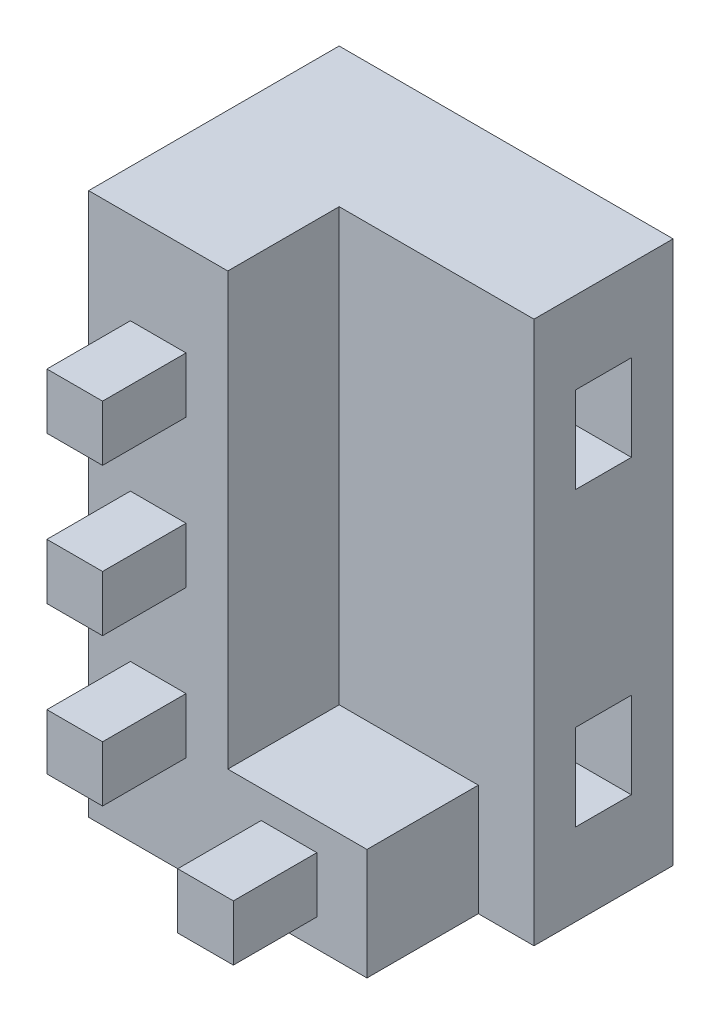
ISO-10303-21;
HEADER;
FILE_DESCRIPTION(('STEP AP214'),'2;1');
FILE_NAME('part.step','',(''),(''),'','','');
FILE_SCHEMA(('AUTOMOTIVE_DESIGN { 1 0 10303 214 1 1 1 1 }'));
ENDSEC;
DATA;
#1=APPLICATION_CONTEXT('core data for automotive mechanical design processes');
#2=APPLICATION_PROTOCOL_DEFINITION('international standard','automotive_design',2000,#1);
#3=PRODUCT_CONTEXT('',#1,'mechanical');
#4=PRODUCT('Part','Part','',(#3));
#5=PRODUCT_RELATED_PRODUCT_CATEGORY('part','',(#4));
#6=PRODUCT_DEFINITION_FORMATION('','',#4);
#7=PRODUCT_DEFINITION_CONTEXT('part definition',#1,'design');
#8=PRODUCT_DEFINITION('design','',#6,#7);
#9=PRODUCT_DEFINITION_SHAPE('','',#8);
#10=(LENGTH_UNIT() NAMED_UNIT(*) SI_UNIT(.MILLI.,.METRE.));
#11=(NAMED_UNIT(*) PLANE_ANGLE_UNIT() SI_UNIT($,.RADIAN.));
#12=(NAMED_UNIT(*) SI_UNIT($,.STERADIAN.) SOLID_ANGLE_UNIT());
#13=UNCERTAINTY_MEASURE_WITH_UNIT(LENGTH_MEASURE(1.E-05),#10,'distance_accuracy_value','');
#14=(GEOMETRIC_REPRESENTATION_CONTEXT(3) GLOBAL_UNCERTAINTY_ASSIGNED_CONTEXT((#13)) GLOBAL_UNIT_ASSIGNED_CONTEXT((#10,
#11,#12)) REPRESENTATION_CONTEXT('',''));
#15=CARTESIAN_POINT('',(0.,0.,0.));
#16=DIRECTION('',(0.,0.,1.));
#17=DIRECTION('',(1.,0.,0.));
#18=AXIS2_PLACEMENT_3D('',#15,#16,#17);
#19=CARTESIAN_POINT('',(-90.9999999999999,0.,-235.));
#20=DIRECTION('',(0.,0.,-1.));
#21=DIRECTION('',(-1.,0.,0.));
#22=AXIS2_PLACEMENT_3D('',#19,#20,#21);
#23=PLANE('',#22);
#24=DIRECTION('',(0.,-1.,0.));
#25=VECTOR('',#24,1.);
#26=CARTESIAN_POINT('',(-4.99999999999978,36.,-235.));
#27=LINE('',#26,#25);
#28=CARTESIAN_POINT('',(-4.99999999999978,56.,-235.));
#29=VERTEX_POINT('',#28);
#30=CARTESIAN_POINT('',(-4.99999999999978,36.,-235.));
#31=VERTEX_POINT('',#30);
#32=EDGE_CURVE('E444',#29,#31,#27,.T.);
#33=ORIENTED_EDGE('',*,*,#32,.F.);
#34=DIRECTION('',(-1.,0.,0.));
#35=VECTOR('',#34,1.);
#36=CARTESIAN_POINT('',(-4.99999999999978,56.,-235.));
#37=LINE('',#36,#35);
#38=CARTESIAN_POINT('',(15.0000000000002,56.,-235.));
#39=VERTEX_POINT('',#38);
#40=EDGE_CURVE('E431',#39,#29,#37,.T.);
#41=ORIENTED_EDGE('',*,*,#40,.F.);
#42=DIRECTION('',(0.,1.,0.));
#43=VECTOR('',#42,1.);
#44=CARTESIAN_POINT('',(15.0000000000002,56.,-235.));
#45=LINE('',#44,#43);
#46=CARTESIAN_POINT('',(15.0000000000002,36.,-235.));
#47=VERTEX_POINT('',#46);
#48=EDGE_CURVE('E435',#47,#39,#45,.T.);
#49=ORIENTED_EDGE('',*,*,#48,.F.);
#50=DIRECTION('',(1.,0.,0.));
#51=VECTOR('',#50,1.);
#52=CARTESIAN_POINT('',(15.0000000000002,36.,-235.));
#53=LINE('',#52,#51);
#54=EDGE_CURVE('E440',#31,#47,#53,.T.);
#55=ORIENTED_EDGE('',*,*,#54,.F.);
#56=EDGE_LOOP('',(#33,#41,#49,#55));
#57=FACE_BOUND('',#56,.T.);
#58=DIRECTION('',(-1.,0.,0.));
#59=VECTOR('',#58,1.);
#60=CARTESIAN_POINT('',(-4.99999999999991,162.,-235.));
#61=LINE('',#60,#59);
#62=CARTESIAN_POINT('',(15.0000000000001,162.,-235.));
#63=VERTEX_POINT('',#62);
#64=CARTESIAN_POINT('',(-4.99999999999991,162.,-235.));
#65=VERTEX_POINT('',#64);
#66=EDGE_CURVE('E493',#63,#65,#61,.T.);
#67=ORIENTED_EDGE('',*,*,#66,.F.);
#68=DIRECTION('',(0.,1.,0.));
#69=VECTOR('',#68,1.);
#70=CARTESIAN_POINT('',(15.0000000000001,162.,-235.));
#71=LINE('',#70,#69);
#72=CARTESIAN_POINT('',(15.0000000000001,142.,-235.));
#73=VERTEX_POINT('',#72);
#74=EDGE_CURVE('E510',#73,#63,#71,.T.);
#75=ORIENTED_EDGE('',*,*,#74,.F.);
#76=DIRECTION('',(1.,0.,0.));
#77=VECTOR('',#76,1.);
#78=CARTESIAN_POINT('',(15.0000000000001,142.,-235.));
#79=LINE('',#78,#77);
#80=CARTESIAN_POINT('',(-4.99999999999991,142.,-235.));
#81=VERTEX_POINT('',#80);
#82=EDGE_CURVE('E527',#81,#73,#79,.T.);
#83=ORIENTED_EDGE('',*,*,#82,.F.);
#84=DIRECTION('',(0.,-1.,0.));
#85=VECTOR('',#84,1.);
#86=CARTESIAN_POINT('',(-4.99999999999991,162.,-235.));
#87=LINE('',#86,#85);
#88=EDGE_CURVE('E523',#65,#81,#87,.T.);
#89=ORIENTED_EDGE('',*,*,#88,.F.);
#90=EDGE_LOOP('',(#67,#75,#83,#89));
#91=FACE_BOUND('',#90,.T.);
#92=DIRECTION('',(0.,1.,0.));
#93=VECTOR('',#92,1.);
#94=CARTESIAN_POINT('',(-20.,250.,-235.));
#95=LINE('',#94,#93);
#96=CARTESIAN_POINT('',(-19.9999999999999,0.,-235.));
#97=VERTEX_POINT('',#96);
#98=CARTESIAN_POINT('',(-20.,195.,-235.));
#99=VERTEX_POINT('',#98);
#100=EDGE_CURVE('E588',#97,#99,#95,.T.);
#101=ORIENTED_EDGE('',*,*,#100,.F.);
#102=DIRECTION('',(-1.,0.,0.));
#103=VECTOR('',#102,1.);
#104=CARTESIAN_POINT('',(-90.9999999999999,0.,-235.));
#105=LINE('',#104,#103);
#106=CARTESIAN_POINT('',(80.,0.,-235.));
#107=VERTEX_POINT('',#106);
#108=EDGE_CURVE('E580',#107,#97,#105,.T.);
#109=ORIENTED_EDGE('',*,*,#108,.F.);
#110=DIRECTION('',(0.,1.,0.));
#111=VECTOR('',#110,1.);
#112=CARTESIAN_POINT('',(80.,0.,-235.));
#113=LINE('',#112,#111);
#114=CARTESIAN_POINT('',(80.,40.,-235.));
#115=VERTEX_POINT('',#114);
#116=EDGE_CURVE('E554',#107,#115,#113,.T.);
#117=ORIENTED_EDGE('',*,*,#116,.T.);
#118=DIRECTION('',(1.,0.,0.));
#119=VECTOR('',#118,1.);
#120=CARTESIAN_POINT('',(30.,40.,-235.));
#121=LINE('',#120,#119);
#122=CARTESIAN_POINT('',(30.,40.,-235.));
#123=VERTEX_POINT('',#122);
#124=EDGE_CURVE('E559',#123,#115,#121,.T.);
#125=ORIENTED_EDGE('',*,*,#124,.F.);
#126=DIRECTION('',(0.,-1.,0.));
#127=VECTOR('',#126,1.);
#128=CARTESIAN_POINT('',(30.,250.,-235.));
#129=LINE('',#128,#127);
#130=CARTESIAN_POINT('',(30.,195.,-235.));
#131=VERTEX_POINT('',#130);
#132=EDGE_CURVE('E12',#131,#123,#129,.T.);
#133=ORIENTED_EDGE('',*,*,#132,.F.);
#134=DIRECTION('',(1.,0.,0.));
#135=VECTOR('',#134,1.);
#136=CARTESIAN_POINT('',(0.,195.,-235.));
#137=LINE('',#136,#135);
#138=EDGE_CURVE('E584',#99,#131,#137,.T.);
#139=ORIENTED_EDGE('',*,*,#138,.F.);
#140=EDGE_LOOP('',(#101,#109,#117,#125,#133,#139));
#141=FACE_BOUND('',#140,.T.);
#142=DIRECTION('',(0.,-1.,0.));
#143=VECTOR('',#142,1.);
#144=CARTESIAN_POINT('',(-4.99999999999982,89.,-235.));
#145=LINE('',#144,#143);
#146=CARTESIAN_POINT('',(-4.99999999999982,109.,-235.));
#147=VERTEX_POINT('',#146);
#148=CARTESIAN_POINT('',(-4.99999999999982,89.,-235.));
#149=VERTEX_POINT('',#148);
#150=EDGE_CURVE('E489',#147,#149,#145,.T.);
#151=ORIENTED_EDGE('',*,*,#150,.F.);
#152=DIRECTION('',(-1.,0.,0.));
#153=VECTOR('',#152,1.);
#154=CARTESIAN_POINT('',(-4.99999999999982,109.,-235.));
#155=LINE('',#154,#153);
#156=CARTESIAN_POINT('',(15.0000000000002,109.,-235.));
#157=VERTEX_POINT('',#156);
#158=EDGE_CURVE('E476',#157,#147,#155,.T.);
#159=ORIENTED_EDGE('',*,*,#158,.F.);
#160=DIRECTION('',(0.,1.,0.));
#161=VECTOR('',#160,1.);
#162=CARTESIAN_POINT('',(15.0000000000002,109.,-235.));
#163=LINE('',#162,#161);
#164=CARTESIAN_POINT('',(15.0000000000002,89.,-235.));
#165=VERTEX_POINT('',#164);
#166=EDGE_CURVE('E480',#165,#157,#163,.T.);
#167=ORIENTED_EDGE('',*,*,#166,.F.);
#168=DIRECTION('',(1.,0.,0.));
#169=VECTOR('',#168,1.);
#170=CARTESIAN_POINT('',(15.0000000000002,89.,-235.));
#171=LINE('',#170,#169);
#172=EDGE_CURVE('E485',#149,#165,#171,.T.);
#173=ORIENTED_EDGE('',*,*,#172,.F.);
#174=EDGE_LOOP('',(#151,#159,#167,#173));
#175=FACE_BOUND('',#174,.T.);
#176=DIRECTION('',(0.,-1.,0.));
#177=VECTOR('',#176,1.);
#178=CARTESIAN_POINT('',(42.0000000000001,10.,-235.));
#179=LINE('',#178,#177);
#180=CARTESIAN_POINT('',(42.0000000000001,30.,-235.));
#181=VERTEX_POINT('',#180);
#182=CARTESIAN_POINT('',(42.0000000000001,10.,-235.));
#183=VERTEX_POINT('',#182);
#184=EDGE_CURVE('E399',#181,#183,#179,.T.);
#185=ORIENTED_EDGE('',*,*,#184,.F.);
#186=DIRECTION('',(-1.,0.,0.));
#187=VECTOR('',#186,1.);
#188=CARTESIAN_POINT('',(42.0000000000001,30.,-235.));
#189=LINE('',#188,#187);
#190=CARTESIAN_POINT('',(62.0000000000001,30.,-235.));
#191=VERTEX_POINT('',#190);
#192=EDGE_CURVE('E386',#191,#181,#189,.T.);
#193=ORIENTED_EDGE('',*,*,#192,.F.);
#194=DIRECTION('',(0.,1.,0.));
#195=VECTOR('',#194,1.);
#196=CARTESIAN_POINT('',(62.0000000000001,30.,-235.));
#197=LINE('',#196,#195);
#198=CARTESIAN_POINT('',(62.0000000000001,10.,-235.));
#199=VERTEX_POINT('',#198);
#200=EDGE_CURVE('E390',#199,#191,#197,.T.);
#201=ORIENTED_EDGE('',*,*,#200,.F.);
#202=DIRECTION('',(1.,0.,0.));
#203=VECTOR('',#202,1.);
#204=CARTESIAN_POINT('',(62.0000000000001,10.,-235.));
#205=LINE('',#204,#203);
#206=EDGE_CURVE('E395',#183,#199,#205,.T.);
#207=ORIENTED_EDGE('',*,*,#206,.F.);
#208=EDGE_LOOP('',(#185,#193,#201,#207));
#209=FACE_BOUND('',#208,.T.);
#210=ADVANCED_FACE('F53',(#57,#91,#141,#175,#209),#23,.F.);
#211=CARTESIAN_POINT('',(230.,250.,-275.011815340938));
#212=DIRECTION('',(0.,0.,-1.));
#213=DIRECTION('',(-1.,0.,0.));
#214=AXIS2_PLACEMENT_3D('',#211,#212,#213);
#215=PLANE('',#214);
#216=DIRECTION('',(-1.,0.,0.));
#217=VECTOR('',#216,1.);
#218=CARTESIAN_POINT('',(230.,0.,-275.011815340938));
#219=LINE('',#218,#217);
#220=CARTESIAN_POINT('',(100.,0.,-275.011815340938));
#221=VERTEX_POINT('',#220);
#222=CARTESIAN_POINT('',(80.,0.,-275.011815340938));
#223=VERTEX_POINT('',#222);
#224=EDGE_CURVE('E610',#221,#223,#219,.T.);
#225=ORIENTED_EDGE('',*,*,#224,.F.);
#226=DIRECTION('',(0.,1.,0.));
#227=VECTOR('',#226,1.);
#228=CARTESIAN_POINT('',(100.,250.,-275.011815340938));
#229=LINE('',#228,#227);
#230=CARTESIAN_POINT('',(100.,195.,-275.011815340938));
#231=VERTEX_POINT('',#230);
#232=EDGE_CURVE('E363',#221,#231,#229,.T.);
#233=ORIENTED_EDGE('',*,*,#232,.T.);
#234=DIRECTION('',(1.,0.,0.));
#235=VECTOR('',#234,1.);
#236=CARTESIAN_POINT('',(230.,195.,-275.011815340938));
#237=LINE('',#236,#235);
#238=CARTESIAN_POINT('',(30.,195.,-275.011815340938));
#239=VERTEX_POINT('',#238);
#240=EDGE_CURVE('E599',#239,#231,#237,.T.);
#241=ORIENTED_EDGE('',*,*,#240,.F.);
#242=DIRECTION('',(0.,-1.,0.));
#243=VECTOR('',#242,1.);
#244=CARTESIAN_POINT('',(30.,250.,-275.011815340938));
#245=LINE('',#244,#243);
#246=CARTESIAN_POINT('',(30.,40.,-275.011815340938));
#247=VERTEX_POINT('',#246);
#248=EDGE_CURVE('E606',#239,#247,#245,.T.);
#249=ORIENTED_EDGE('',*,*,#248,.T.);
#250=DIRECTION('',(-1.,0.,0.));
#251=VECTOR('',#250,1.);
#252=CARTESIAN_POINT('',(30.,40.,-275.011815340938));
#253=LINE('',#252,#251);
#254=CARTESIAN_POINT('',(80.,40.,-275.011815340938));
#255=VERTEX_POINT('',#254);
#256=EDGE_CURVE('E555',#255,#247,#253,.T.);
#257=ORIENTED_EDGE('',*,*,#256,.F.);
#258=DIRECTION('',(0.,1.,0.));
#259=VECTOR('',#258,1.);
#260=CARTESIAN_POINT('',(80.,0.,-275.011815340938));
#261=LINE('',#260,#259);
#262=EDGE_CURVE('E570',#223,#255,#261,.T.);
#263=ORIENTED_EDGE('',*,*,#262,.F.);
#264=EDGE_LOOP('',(#225,#233,#241,#249,#257,#263));
#265=FACE_BOUND('',#264,.T.);
#266=ADVANCED_FACE('F647',(#265),#215,.F.);
#267=CARTESIAN_POINT('',(-20.,250.,0.));
#268=DIRECTION('',(1.,0.,0.));
#269=DIRECTION('',(0.,0.,-1.));
#270=AXIS2_PLACEMENT_3D('',#267,#268,#269);
#271=PLANE('',#270);
#272=DIRECTION('',(0.,1.,0.));
#273=VECTOR('',#272,1.);
#274=CARTESIAN_POINT('',(-19.9999999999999,62.5,-325.));
#275=LINE('',#274,#273);
#276=CARTESIAN_POINT('',(-19.9999999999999,0.,-325.));
#277=VERTEX_POINT('',#276);
#278=CARTESIAN_POINT('',(-19.9999999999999,195.,-325.));
#279=VERTEX_POINT('',#278);
#280=EDGE_CURVE('E62',#277,#279,#275,.T.);
#281=ORIENTED_EDGE('',*,*,#280,.F.);
#282=DIRECTION('',(0.,0.,-1.));
#283=VECTOR('',#282,1.);
#284=CARTESIAN_POINT('',(-19.9999999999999,0.,-325.));
#285=LINE('',#284,#283);
#286=EDGE_CURVE('E574',#97,#277,#285,.T.);
#287=ORIENTED_EDGE('',*,*,#286,.F.);
#288=ORIENTED_EDGE('',*,*,#100,.T.);
#289=DIRECTION('',(0.,0.,-1.));
#290=VECTOR('',#289,1.);
#291=CARTESIAN_POINT('',(-20.,195.,0.));
#292=LINE('',#291,#290);
#293=EDGE_CURVE('E595',#99,#279,#292,.T.);
#294=ORIENTED_EDGE('',*,*,#293,.T.);
#295=EDGE_LOOP('',(#281,#287,#288,#294));
#296=FACE_BOUND('',#295,.T.);
#297=ADVANCED_FACE('F624',(#296),#271,.F.);
#298=CARTESIAN_POINT('',(0.,0.,0.));
#299=DIRECTION('',(0.,-1.,0.));
#300=DIRECTION('',(0.,0.,-1.));
#301=AXIS2_PLACEMENT_3D('',#298,#299,#300);
#302=PLANE('',#301);
#303=DIRECTION('',(0.,0.,1.));
#304=VECTOR('',#303,1.);
#305=CARTESIAN_POINT('',(100.,0.,-325.));
#306=LINE('',#305,#304);
#307=CARTESIAN_POINT('',(100.,0.,-325.));
#308=VERTEX_POINT('',#307);
#309=EDGE_CURVE('E359',#308,#221,#306,.T.);
#310=ORIENTED_EDGE('',*,*,#309,.T.);
#311=ORIENTED_EDGE('',*,*,#224,.T.);
#312=DIRECTION('',(0.,0.,-1.));
#313=VECTOR('',#312,1.);
#314=CARTESIAN_POINT('',(80.,0.,-235.));
#315=LINE('',#314,#313);
#316=EDGE_CURVE('E550',#107,#223,#315,.T.);
#317=ORIENTED_EDGE('',*,*,#316,.F.);
#318=ORIENTED_EDGE('',*,*,#108,.T.);
#319=ORIENTED_EDGE('',*,*,#286,.T.);
#320=DIRECTION('',(-1.,0.,0.));
#321=VECTOR('',#320,1.);
#322=CARTESIAN_POINT('',(101.037708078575,0.,-325.));
#323=LINE('',#322,#321);
#324=EDGE_CURVE('E613',#308,#277,#323,.T.);
#325=ORIENTED_EDGE('',*,*,#324,.F.);
#326=EDGE_LOOP('',(#310,#311,#317,#318,#319,#325));
#327=FACE_BOUND('',#326,.T.);
#328=ADVANCED_FACE('F627',(#327),#302,.T.);
#329=CARTESIAN_POINT('',(101.037708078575,71.6208477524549,-325.));
#330=DIRECTION('',(0.,0.,-1.));
#331=DIRECTION('',(-1.,0.,0.));
#332=AXIS2_PLACEMENT_3D('',#329,#330,#331);
#333=PLANE('',#332);
#334=DIRECTION('',(0.,-1.,0.));
#335=VECTOR('',#334,1.);
#336=CARTESIAN_POINT('',(100.,0.,-325.));
#337=LINE('',#336,#335);
#338=CARTESIAN_POINT('',(100.,195.,-325.));
#339=VERTEX_POINT('',#338);
#340=EDGE_CURVE('E309',#339,#308,#337,.T.);
#341=ORIENTED_EDGE('',*,*,#340,.T.);
#342=ORIENTED_EDGE('',*,*,#324,.T.);
#343=ORIENTED_EDGE('',*,*,#280,.T.);
#344=DIRECTION('',(-1.,0.,0.));
#345=VECTOR('',#344,1.);
#346=CARTESIAN_POINT('',(30.,195.,-325.));
#347=LINE('',#346,#345);
#348=EDGE_CURVE('E603',#339,#279,#347,.T.);
#349=ORIENTED_EDGE('',*,*,#348,.F.);
#350=EDGE_LOOP('',(#341,#342,#343,#349));
#351=FACE_BOUND('',#350,.T.);
#352=ADVANCED_FACE('F620',(#351),#333,.T.);
#353=CARTESIAN_POINT('',(0.,195.,0.));
#354=DIRECTION('',(0.,-1.,0.));
#355=DIRECTION('',(0.,0.,-1.));
#356=AXIS2_PLACEMENT_3D('',#353,#354,#355);
#357=PLANE('',#356);
#358=ORIENTED_EDGE('',*,*,#240,.T.);
#359=DIRECTION('',(0.,0.,1.));
#360=VECTOR('',#359,1.);
#361=CARTESIAN_POINT('',(100.,195.,-325.));
#362=LINE('',#361,#360);
#363=EDGE_CURVE('E358',#339,#231,#362,.T.);
#364=ORIENTED_EDGE('',*,*,#363,.F.);
#365=ORIENTED_EDGE('',*,*,#348,.T.);
#366=ORIENTED_EDGE('',*,*,#293,.F.);
#367=ORIENTED_EDGE('',*,*,#138,.T.);
#368=DIRECTION('',(0.,0.,-1.));
#369=VECTOR('',#368,1.);
#370=CARTESIAN_POINT('',(30.,195.,-142.943134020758));
#371=LINE('',#370,#369);
#372=EDGE_CURVE('E592',#131,#239,#371,.T.);
#373=ORIENTED_EDGE('',*,*,#372,.T.);
#374=EDGE_LOOP('',(#358,#364,#365,#366,#367,#373));
#375=FACE_BOUND('',#374,.T.);
#376=ADVANCED_FACE('F642',(#375),#357,.F.);
#377=CARTESIAN_POINT('',(30.,250.,-150.));
#378=DIRECTION('',(-1.,0.,0.));
#379=DIRECTION('',(0.,0.,1.));
#380=AXIS2_PLACEMENT_3D('',#377,#378,#379);
#381=PLANE('',#380);
#382=ORIENTED_EDGE('',*,*,#132,.T.);
#383=DIRECTION('',(0.,0.,1.));
#384=VECTOR('',#383,1.);
#385=CARTESIAN_POINT('',(30.,40.,-275.011815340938));
#386=LINE('',#385,#384);
#387=EDGE_CURVE('E549',#247,#123,#386,.T.);
#388=ORIENTED_EDGE('',*,*,#387,.F.);
#389=ORIENTED_EDGE('',*,*,#248,.F.);
#390=ORIENTED_EDGE('',*,*,#372,.F.);
#391=EDGE_LOOP('',(#382,#388,#389,#390));
#392=FACE_BOUND('',#391,.T.);
#393=ADVANCED_FACE('F55',(#392),#381,.F.);
#394=CARTESIAN_POINT('',(80.,0.,-235.));
#395=DIRECTION('',(1.,0.,0.));
#396=DIRECTION('',(0.,0.,-1.));
#397=AXIS2_PLACEMENT_3D('',#394,#395,#396);
#398=PLANE('',#397);
#399=DIRECTION('',(0.,0.,-1.));
#400=VECTOR('',#399,1.);
#401=CARTESIAN_POINT('',(80.,40.,-235.));
#402=LINE('',#401,#400);
#403=EDGE_CURVE('E563',#115,#255,#402,.T.);
#404=ORIENTED_EDGE('',*,*,#403,.F.);
#405=ORIENTED_EDGE('',*,*,#116,.F.);
#406=ORIENTED_EDGE('',*,*,#316,.T.);
#407=ORIENTED_EDGE('',*,*,#262,.T.);
#408=EDGE_LOOP('',(#404,#405,#406,#407));
#409=FACE_BOUND('',#408,.T.);
#410=ADVANCED_FACE('F635',(#409),#398,.T.);
#411=CARTESIAN_POINT('',(0.,40.,0.));
#412=DIRECTION('',(0.,1.,0.));
#413=DIRECTION('',(0.,0.,1.));
#414=AXIS2_PLACEMENT_3D('',#411,#412,#413);
#415=PLANE('',#414);
#416=ORIENTED_EDGE('',*,*,#387,.T.);
#417=ORIENTED_EDGE('',*,*,#124,.T.);
#418=ORIENTED_EDGE('',*,*,#403,.T.);
#419=ORIENTED_EDGE('',*,*,#256,.T.);
#420=EDGE_LOOP('',(#416,#417,#418,#419));
#421=FACE_BOUND('',#420,.T.);
#422=ADVANCED_FACE('F638',(#421),#415,.T.);
#423=CARTESIAN_POINT('',(-4.99999999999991,162.,-205.));
#424=DIRECTION('',(0.,-1.,0.));
#425=DIRECTION('',(0.,0.,-1.));
#426=AXIS2_PLACEMENT_3D('',#423,#424,#425);
#427=PLANE('',#426);
#428=ORIENTED_EDGE('',*,*,#66,.T.);
#429=DIRECTION('',(0.,0.,-1.));
#430=VECTOR('',#429,1.);
#431=CARTESIAN_POINT('',(-4.99999999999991,162.,-205.));
#432=LINE('',#431,#430);
#433=CARTESIAN_POINT('',(-4.99999999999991,162.,-205.));
#434=VERTEX_POINT('',#433);
#435=EDGE_CURVE('E545',#434,#65,#432,.T.);
#436=ORIENTED_EDGE('',*,*,#435,.F.);
#437=DIRECTION('',(-1.,0.,0.));
#438=VECTOR('',#437,1.);
#439=CARTESIAN_POINT('',(-4.99999999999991,162.,-205.));
#440=LINE('',#439,#438);
#441=CARTESIAN_POINT('',(15.0000000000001,162.,-205.));
#442=VERTEX_POINT('',#441);
#443=EDGE_CURVE('E505',#442,#434,#440,.T.);
#444=ORIENTED_EDGE('',*,*,#443,.F.);
#445=DIRECTION('',(0.,0.,-1.));
#446=VECTOR('',#445,1.);
#447=CARTESIAN_POINT('',(15.0000000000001,162.,-205.));
#448=LINE('',#447,#446);
#449=EDGE_CURVE('E519',#442,#63,#448,.T.);
#450=ORIENTED_EDGE('',*,*,#449,.T.);
#451=EDGE_LOOP('',(#428,#436,#444,#450));
#452=FACE_BOUND('',#451,.T.);
#453=ADVANCED_FACE('F731',(#452),#427,.F.);
#454=CARTESIAN_POINT('',(-4.99999999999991,162.,-205.));
#455=DIRECTION('',(1.,0.,0.));
#456=DIRECTION('',(0.,1.,0.));
#457=AXIS2_PLACEMENT_3D('',#454,#455,#456);
#458=PLANE('',#457);
#459=ORIENTED_EDGE('',*,*,#88,.T.);
#460=DIRECTION('',(0.,0.,-1.));
#461=VECTOR('',#460,1.);
#462=CARTESIAN_POINT('',(-4.9999999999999,142.,-205.));
#463=LINE('',#462,#461);
#464=CARTESIAN_POINT('',(-4.9999999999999,142.,-205.));
#465=VERTEX_POINT('',#464);
#466=EDGE_CURVE('E541',#465,#81,#463,.T.);
#467=ORIENTED_EDGE('',*,*,#466,.F.);
#468=DIRECTION('',(0.,-1.,0.));
#469=VECTOR('',#468,1.);
#470=CARTESIAN_POINT('',(-4.99999999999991,162.,-205.));
#471=LINE('',#470,#469);
#472=EDGE_CURVE('E509',#434,#465,#471,.T.);
#473=ORIENTED_EDGE('',*,*,#472,.F.);
#474=ORIENTED_EDGE('',*,*,#435,.T.);
#475=EDGE_LOOP('',(#459,#467,#473,#474));
#476=FACE_BOUND('',#475,.T.);
#477=ADVANCED_FACE('F737',(#476),#458,.F.);
#478=CARTESIAN_POINT('',(15.0000000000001,142.,-205.));
#479=DIRECTION('',(0.,1.,0.));
#480=DIRECTION('',(0.,0.,1.));
#481=AXIS2_PLACEMENT_3D('',#478,#479,#480);
#482=PLANE('',#481);
#483=ORIENTED_EDGE('',*,*,#82,.T.);
#484=DIRECTION('',(0.,0.,-1.));
#485=VECTOR('',#484,1.);
#486=CARTESIAN_POINT('',(15.0000000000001,142.,-205.));
#487=LINE('',#486,#485);
#488=CARTESIAN_POINT('',(15.0000000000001,142.,-205.));
#489=VERTEX_POINT('',#488);
#490=EDGE_CURVE('E537',#489,#73,#487,.T.);
#491=ORIENTED_EDGE('',*,*,#490,.F.);
#492=DIRECTION('',(1.,0.,0.));
#493=VECTOR('',#492,1.);
#494=CARTESIAN_POINT('',(15.0000000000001,142.,-205.));
#495=LINE('',#494,#493);
#496=EDGE_CURVE('E513',#465,#489,#495,.T.);
#497=ORIENTED_EDGE('',*,*,#496,.F.);
#498=ORIENTED_EDGE('',*,*,#466,.T.);
#499=EDGE_LOOP('',(#483,#491,#497,#498));
#500=FACE_BOUND('',#499,.T.);
#501=ADVANCED_FACE('F745',(#500),#482,.F.);
#502=CARTESIAN_POINT('',(15.0000000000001,162.,-205.));
#503=DIRECTION('',(-1.,0.,0.));
#504=DIRECTION('',(0.,-1.,0.));
#505=AXIS2_PLACEMENT_3D('',#502,#503,#504);
#506=PLANE('',#505);
#507=ORIENTED_EDGE('',*,*,#74,.T.);
#508=ORIENTED_EDGE('',*,*,#449,.F.);
#509=DIRECTION('',(0.,1.,0.));
#510=VECTOR('',#509,1.);
#511=CARTESIAN_POINT('',(15.0000000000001,162.,-205.));
#512=LINE('',#511,#510);
#513=EDGE_CURVE('E516',#489,#442,#512,.T.);
#514=ORIENTED_EDGE('',*,*,#513,.F.);
#515=ORIENTED_EDGE('',*,*,#490,.T.);
#516=EDGE_LOOP('',(#507,#508,#514,#515));
#517=FACE_BOUND('',#516,.T.);
#518=ADVANCED_FACE('F753',(#517),#506,.F.);
#519=CARTESIAN_POINT('',(0.,0.,-205.));
#520=DIRECTION('',(0.,0.,-1.));
#521=DIRECTION('',(-1.,0.,0.));
#522=AXIS2_PLACEMENT_3D('',#519,#520,#521);
#523=PLANE('',#522);
#524=ORIENTED_EDGE('',*,*,#443,.T.);
#525=ORIENTED_EDGE('',*,*,#472,.T.);
#526=ORIENTED_EDGE('',*,*,#496,.T.);
#527=ORIENTED_EDGE('',*,*,#513,.T.);
#528=EDGE_LOOP('',(#524,#525,#526,#527));
#529=FACE_BOUND('',#528,.T.);
#530=ADVANCED_FACE('F761',(#529),#523,.F.);
#531=CARTESIAN_POINT('',(-4.99999999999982,89.,-205.));
#532=DIRECTION('',(1.,0.,0.));
#533=DIRECTION('',(0.,0.,-1.));
#534=AXIS2_PLACEMENT_3D('',#531,#532,#533);
#535=PLANE('',#534);
#536=ORIENTED_EDGE('',*,*,#150,.T.);
#537=DIRECTION('',(0.,0.,-1.));
#538=VECTOR('',#537,1.);
#539=CARTESIAN_POINT('',(-4.99999999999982,89.,-205.));
#540=LINE('',#539,#538);
#541=CARTESIAN_POINT('',(-4.99999999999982,89.,-205.));
#542=VERTEX_POINT('',#541);
#543=EDGE_CURVE('E448',#542,#149,#540,.T.);
#544=ORIENTED_EDGE('',*,*,#543,.F.);
#545=DIRECTION('',(0.,-1.,0.));
#546=VECTOR('',#545,1.);
#547=CARTESIAN_POINT('',(-4.99999999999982,89.,-205.));
#548=LINE('',#547,#546);
#549=CARTESIAN_POINT('',(-4.99999999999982,109.,-205.));
#550=VERTEX_POINT('',#549);
#551=EDGE_CURVE('E481',#550,#542,#548,.T.);
#552=ORIENTED_EDGE('',*,*,#551,.F.);
#553=DIRECTION('',(0.,0.,-1.));
#554=VECTOR('',#553,1.);
#555=CARTESIAN_POINT('',(-4.99999999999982,109.,-205.));
#556=LINE('',#555,#554);
#557=EDGE_CURVE('E471',#550,#147,#556,.T.);
#558=ORIENTED_EDGE('',*,*,#557,.T.);
#559=EDGE_LOOP('',(#536,#544,#552,#558));
#560=FACE_BOUND('',#559,.T.);
#561=ADVANCED_FACE('F769',(#560),#535,.F.);
#562=CARTESIAN_POINT('',(15.0000000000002,89.,-205.));
#563=DIRECTION('',(0.,1.,0.));
#564=DIRECTION('',(0.,0.,1.));
#565=AXIS2_PLACEMENT_3D('',#562,#563,#564);
#566=PLANE('',#565);
#567=ORIENTED_EDGE('',*,*,#172,.T.);
#568=DIRECTION('',(0.,0.,-1.));
#569=VECTOR('',#568,1.);
#570=CARTESIAN_POINT('',(15.0000000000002,89.,-205.));
#571=LINE('',#570,#569);
#572=CARTESIAN_POINT('',(15.0000000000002,89.,-205.));
#573=VERTEX_POINT('',#572);
#574=EDGE_CURVE('E463',#573,#165,#571,.T.);
#575=ORIENTED_EDGE('',*,*,#574,.F.);
#576=DIRECTION('',(1.,0.,0.));
#577=VECTOR('',#576,1.);
#578=CARTESIAN_POINT('',(15.0000000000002,89.,-205.));
#579=LINE('',#578,#577);
#580=EDGE_CURVE('E499',#542,#573,#579,.T.);
#581=ORIENTED_EDGE('',*,*,#580,.F.);
#582=ORIENTED_EDGE('',*,*,#543,.T.);
#583=EDGE_LOOP('',(#567,#575,#581,#582));
#584=FACE_BOUND('',#583,.T.);
#585=ADVANCED_FACE('F777',(#584),#566,.F.);
#586=CARTESIAN_POINT('',(15.0000000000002,109.,-205.));
#587=DIRECTION('',(-1.,0.,0.));
#588=DIRECTION('',(0.,0.,1.));
#589=AXIS2_PLACEMENT_3D('',#586,#587,#588);
#590=PLANE('',#589);
#591=ORIENTED_EDGE('',*,*,#166,.T.);
#592=DIRECTION('',(0.,0.,-1.));
#593=VECTOR('',#592,1.);
#594=CARTESIAN_POINT('',(15.0000000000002,109.,-205.));
#595=LINE('',#594,#593);
#596=CARTESIAN_POINT('',(15.0000000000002,109.,-205.));
#597=VERTEX_POINT('',#596);
#598=EDGE_CURVE('E467',#597,#157,#595,.T.);
#599=ORIENTED_EDGE('',*,*,#598,.F.);
#600=DIRECTION('',(0.,1.,0.));
#601=VECTOR('',#600,1.);
#602=CARTESIAN_POINT('',(15.0000000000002,109.,-205.));
#603=LINE('',#602,#601);
#604=EDGE_CURVE('E496',#573,#597,#603,.T.);
#605=ORIENTED_EDGE('',*,*,#604,.F.);
#606=ORIENTED_EDGE('',*,*,#574,.T.);
#607=EDGE_LOOP('',(#591,#599,#605,#606));
#608=FACE_BOUND('',#607,.T.);
#609=ADVANCED_FACE('F785',(#608),#590,.F.);
#610=CARTESIAN_POINT('',(-4.99999999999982,109.,-205.));
#611=DIRECTION('',(0.,-1.,0.));
#612=DIRECTION('',(0.,0.,-1.));
#613=AXIS2_PLACEMENT_3D('',#610,#611,#612);
#614=PLANE('',#613);
#615=ORIENTED_EDGE('',*,*,#158,.T.);
#616=ORIENTED_EDGE('',*,*,#557,.F.);
#617=DIRECTION('',(-1.,0.,0.));
#618=VECTOR('',#617,1.);
#619=CARTESIAN_POINT('',(-4.99999999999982,109.,-205.));
#620=LINE('',#619,#618);
#621=EDGE_CURVE('E475',#597,#550,#620,.T.);
#622=ORIENTED_EDGE('',*,*,#621,.F.);
#623=ORIENTED_EDGE('',*,*,#598,.T.);
#624=EDGE_LOOP('',(#615,#616,#622,#623));
#625=FACE_BOUND('',#624,.T.);
#626=ADVANCED_FACE('F793',(#625),#614,.F.);
#627=CARTESIAN_POINT('',(0.,0.,-205.));
#628=DIRECTION('',(0.,0.,-1.));
#629=DIRECTION('',(-1.,0.,0.));
#630=AXIS2_PLACEMENT_3D('',#627,#628,#629);
#631=PLANE('',#630);
#632=ORIENTED_EDGE('',*,*,#551,.T.);
#633=ORIENTED_EDGE('',*,*,#580,.T.);
#634=ORIENTED_EDGE('',*,*,#604,.T.);
#635=ORIENTED_EDGE('',*,*,#621,.T.);
#636=EDGE_LOOP('',(#632,#633,#634,#635));
#637=FACE_BOUND('',#636,.T.);
#638=ADVANCED_FACE('F801',(#637),#631,.F.);
#639=CARTESIAN_POINT('',(-4.99999999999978,36.,-205.));
#640=DIRECTION('',(1.,0.,0.));
#641=DIRECTION('',(0.,0.,-1.));
#642=AXIS2_PLACEMENT_3D('',#639,#640,#641);
#643=PLANE('',#642);
#644=ORIENTED_EDGE('',*,*,#32,.T.);
#645=DIRECTION('',(0.,0.,-1.));
#646=VECTOR('',#645,1.);
#647=CARTESIAN_POINT('',(-4.99999999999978,36.,-205.));
#648=LINE('',#647,#646);
#649=CARTESIAN_POINT('',(-4.99999999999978,36.,-205.));
#650=VERTEX_POINT('',#649);
#651=EDGE_CURVE('E403',#650,#31,#648,.T.);
#652=ORIENTED_EDGE('',*,*,#651,.F.);
#653=DIRECTION('',(0.,-1.,0.));
#654=VECTOR('',#653,1.);
#655=CARTESIAN_POINT('',(-4.99999999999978,36.,-205.));
#656=LINE('',#655,#654);
#657=CARTESIAN_POINT('',(-4.99999999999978,56.,-205.));
#658=VERTEX_POINT('',#657);
#659=EDGE_CURVE('E436',#658,#650,#656,.T.);
#660=ORIENTED_EDGE('',*,*,#659,.F.);
#661=DIRECTION('',(0.,0.,-1.));
#662=VECTOR('',#661,1.);
#663=CARTESIAN_POINT('',(-4.99999999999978,56.,-205.));
#664=LINE('',#663,#662);
#665=EDGE_CURVE('E426',#658,#29,#664,.T.);
#666=ORIENTED_EDGE('',*,*,#665,.T.);
#667=EDGE_LOOP('',(#644,#652,#660,#666));
#668=FACE_BOUND('',#667,.T.);
#669=ADVANCED_FACE('F809',(#668),#643,.F.);
#670=CARTESIAN_POINT('',(15.0000000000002,36.,-205.));
#671=DIRECTION('',(0.,1.,0.));
#672=DIRECTION('',(0.,0.,1.));
#673=AXIS2_PLACEMENT_3D('',#670,#671,#672);
#674=PLANE('',#673);
#675=ORIENTED_EDGE('',*,*,#54,.T.);
#676=DIRECTION('',(0.,0.,-1.));
#677=VECTOR('',#676,1.);
#678=CARTESIAN_POINT('',(15.0000000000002,36.,-205.));
#679=LINE('',#678,#677);
#680=CARTESIAN_POINT('',(15.0000000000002,36.,-205.));
#681=VERTEX_POINT('',#680);
#682=EDGE_CURVE('E418',#681,#47,#679,.T.);
#683=ORIENTED_EDGE('',*,*,#682,.F.);
#684=DIRECTION('',(1.,0.,0.));
#685=VECTOR('',#684,1.);
#686=CARTESIAN_POINT('',(15.0000000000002,36.,-205.));
#687=LINE('',#686,#685);
#688=EDGE_CURVE('E454',#650,#681,#687,.T.);
#689=ORIENTED_EDGE('',*,*,#688,.F.);
#690=ORIENTED_EDGE('',*,*,#651,.T.);
#691=EDGE_LOOP('',(#675,#683,#689,#690));
#692=FACE_BOUND('',#691,.T.);
#693=ADVANCED_FACE('F817',(#692),#674,.F.);
#694=CARTESIAN_POINT('',(15.0000000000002,56.,-205.));
#695=DIRECTION('',(-1.,0.,0.));
#696=DIRECTION('',(0.,-1.,0.));
#697=AXIS2_PLACEMENT_3D('',#694,#695,#696);
#698=PLANE('',#697);
#699=ORIENTED_EDGE('',*,*,#48,.T.);
#700=DIRECTION('',(0.,0.,-1.));
#701=VECTOR('',#700,1.);
#702=CARTESIAN_POINT('',(15.0000000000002,56.,-205.));
#703=LINE('',#702,#701);
#704=CARTESIAN_POINT('',(15.0000000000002,56.,-205.));
#705=VERTEX_POINT('',#704);
#706=EDGE_CURVE('E422',#705,#39,#703,.T.);
#707=ORIENTED_EDGE('',*,*,#706,.F.);
#708=DIRECTION('',(0.,1.,0.));
#709=VECTOR('',#708,1.);
#710=CARTESIAN_POINT('',(15.0000000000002,56.,-205.));
#711=LINE('',#710,#709);
#712=EDGE_CURVE('E451',#681,#705,#711,.T.);
#713=ORIENTED_EDGE('',*,*,#712,.F.);
#714=ORIENTED_EDGE('',*,*,#682,.T.);
#715=EDGE_LOOP('',(#699,#707,#713,#714));
#716=FACE_BOUND('',#715,.T.);
#717=ADVANCED_FACE('F825',(#716),#698,.F.);
#718=CARTESIAN_POINT('',(-4.99999999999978,56.,-205.));
#719=DIRECTION('',(0.,-1.,0.));
#720=DIRECTION('',(0.,0.,-1.));
#721=AXIS2_PLACEMENT_3D('',#718,#719,#720);
#722=PLANE('',#721);
#723=ORIENTED_EDGE('',*,*,#40,.T.);
#724=ORIENTED_EDGE('',*,*,#665,.F.);
#725=DIRECTION('',(-1.,0.,0.));
#726=VECTOR('',#725,1.);
#727=CARTESIAN_POINT('',(-4.99999999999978,56.,-205.));
#728=LINE('',#727,#726);
#729=EDGE_CURVE('E430',#705,#658,#728,.T.);
#730=ORIENTED_EDGE('',*,*,#729,.F.);
#731=ORIENTED_EDGE('',*,*,#706,.T.);
#732=EDGE_LOOP('',(#723,#724,#730,#731));
#733=FACE_BOUND('',#732,.T.);
#734=ADVANCED_FACE('F833',(#733),#722,.F.);
#735=CARTESIAN_POINT('',(0.,0.,-205.));
#736=DIRECTION('',(0.,0.,-1.));
#737=DIRECTION('',(-1.,0.,0.));
#738=AXIS2_PLACEMENT_3D('',#735,#736,#737);
#739=PLANE('',#738);
#740=ORIENTED_EDGE('',*,*,#659,.T.);
#741=ORIENTED_EDGE('',*,*,#688,.T.);
#742=ORIENTED_EDGE('',*,*,#712,.T.);
#743=ORIENTED_EDGE('',*,*,#729,.T.);
#744=EDGE_LOOP('',(#740,#741,#742,#743));
#745=FACE_BOUND('',#744,.T.);
#746=ADVANCED_FACE('F841',(#745),#739,.F.);
#747=CARTESIAN_POINT('',(42.0000000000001,10.,-205.));
#748=DIRECTION('',(1.,0.,0.));
#749=DIRECTION('',(0.,0.,-1.));
#750=AXIS2_PLACEMENT_3D('',#747,#748,#749);
#751=PLANE('',#750);
#752=ORIENTED_EDGE('',*,*,#184,.T.);
#753=DIRECTION('',(0.,0.,-1.));
#754=VECTOR('',#753,1.);
#755=CARTESIAN_POINT('',(42.0000000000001,10.,-205.));
#756=LINE('',#755,#754);
#757=CARTESIAN_POINT('',(42.0000000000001,10.,-205.));
#758=VERTEX_POINT('',#757);
#759=EDGE_CURVE('E369',#758,#183,#756,.T.);
#760=ORIENTED_EDGE('',*,*,#759,.F.);
#761=DIRECTION('',(0.,-1.,0.));
#762=VECTOR('',#761,1.);
#763=CARTESIAN_POINT('',(42.0000000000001,10.,-205.));
#764=LINE('',#763,#762);
#765=CARTESIAN_POINT('',(42.0000000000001,30.,-205.));
#766=VERTEX_POINT('',#765);
#767=EDGE_CURVE('E391',#766,#758,#764,.T.);
#768=ORIENTED_EDGE('',*,*,#767,.F.);
#769=DIRECTION('',(0.,0.,-1.));
#770=VECTOR('',#769,1.);
#771=CARTESIAN_POINT('',(42.0000000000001,30.,-205.));
#772=LINE('',#771,#770);
#773=EDGE_CURVE('E381',#766,#181,#772,.T.);
#774=ORIENTED_EDGE('',*,*,#773,.T.);
#775=EDGE_LOOP('',(#752,#760,#768,#774));
#776=FACE_BOUND('',#775,.T.);
#777=ADVANCED_FACE('F849',(#776),#751,.F.);
#778=CARTESIAN_POINT('',(62.0000000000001,10.,-205.));
#779=DIRECTION('',(0.,1.,0.));
#780=DIRECTION('',(-1.,0.,0.));
#781=AXIS2_PLACEMENT_3D('',#778,#779,#780);
#782=PLANE('',#781);
#783=ORIENTED_EDGE('',*,*,#206,.T.);
#784=DIRECTION('',(0.,0.,-1.));
#785=VECTOR('',#784,1.);
#786=CARTESIAN_POINT('',(62.0000000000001,10.,-205.));
#787=LINE('',#786,#785);
#788=CARTESIAN_POINT('',(62.0000000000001,10.,-205.));
#789=VERTEX_POINT('',#788);
#790=EDGE_CURVE('E373',#789,#199,#787,.T.);
#791=ORIENTED_EDGE('',*,*,#790,.F.);
#792=DIRECTION('',(1.,0.,0.));
#793=VECTOR('',#792,1.);
#794=CARTESIAN_POINT('',(62.0000000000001,10.,-205.));
#795=LINE('',#794,#793);
#796=EDGE_CURVE('E409',#758,#789,#795,.T.);
#797=ORIENTED_EDGE('',*,*,#796,.F.);
#798=ORIENTED_EDGE('',*,*,#759,.T.);
#799=EDGE_LOOP('',(#783,#791,#797,#798));
#800=FACE_BOUND('',#799,.T.);
#801=ADVANCED_FACE('F857',(#800),#782,.F.);
#802=CARTESIAN_POINT('',(62.0000000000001,30.,-205.));
#803=DIRECTION('',(-1.,0.,0.));
#804=DIRECTION('',(0.,0.,1.));
#805=AXIS2_PLACEMENT_3D('',#802,#803,#804);
#806=PLANE('',#805);
#807=ORIENTED_EDGE('',*,*,#200,.T.);
#808=DIRECTION('',(0.,0.,-1.));
#809=VECTOR('',#808,1.);
#810=CARTESIAN_POINT('',(62.0000000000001,30.,-205.));
#811=LINE('',#810,#809);
#812=CARTESIAN_POINT('',(62.0000000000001,30.,-205.));
#813=VERTEX_POINT('',#812);
#814=EDGE_CURVE('E377',#813,#191,#811,.T.);
#815=ORIENTED_EDGE('',*,*,#814,.F.);
#816=DIRECTION('',(0.,1.,0.));
#817=VECTOR('',#816,1.);
#818=CARTESIAN_POINT('',(62.0000000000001,30.,-205.));
#819=LINE('',#818,#817);
#820=EDGE_CURVE('E406',#789,#813,#819,.T.);
#821=ORIENTED_EDGE('',*,*,#820,.F.);
#822=ORIENTED_EDGE('',*,*,#790,.T.);
#823=EDGE_LOOP('',(#807,#815,#821,#822));
#824=FACE_BOUND('',#823,.T.);
#825=ADVANCED_FACE('F864',(#824),#806,.F.);
#826=CARTESIAN_POINT('',(42.0000000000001,30.,-205.));
#827=DIRECTION('',(0.,-1.,0.));
#828=DIRECTION('',(0.,0.,-1.));
#829=AXIS2_PLACEMENT_3D('',#826,#827,#828);
#830=PLANE('',#829);
#831=ORIENTED_EDGE('',*,*,#192,.T.);
#832=ORIENTED_EDGE('',*,*,#773,.F.);
#833=DIRECTION('',(-1.,0.,0.));
#834=VECTOR('',#833,1.);
#835=CARTESIAN_POINT('',(42.0000000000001,30.,-205.));
#836=LINE('',#835,#834);
#837=EDGE_CURVE('E385',#813,#766,#836,.T.);
#838=ORIENTED_EDGE('',*,*,#837,.F.);
#839=ORIENTED_EDGE('',*,*,#814,.T.);
#840=EDGE_LOOP('',(#831,#832,#838,#839));
#841=FACE_BOUND('',#840,.T.);
#842=ADVANCED_FACE('F664',(#841),#830,.F.);
#843=CARTESIAN_POINT('',(0.,0.,-205.));
#844=DIRECTION('',(0.,0.,-1.));
#845=DIRECTION('',(-1.,0.,0.));
#846=AXIS2_PLACEMENT_3D('',#843,#844,#845);
#847=PLANE('',#846);
#848=ORIENTED_EDGE('',*,*,#767,.T.);
#849=ORIENTED_EDGE('',*,*,#796,.T.);
#850=ORIENTED_EDGE('',*,*,#820,.T.);
#851=ORIENTED_EDGE('',*,*,#837,.T.);
#852=EDGE_LOOP('',(#848,#849,#850,#851));
#853=FACE_BOUND('',#852,.T.);
#854=ADVANCED_FACE('F653',(#853),#847,.F.);
#855=CARTESIAN_POINT('',(100.,0.,-325.));
#856=DIRECTION('',(-1.,0.,0.));
#857=DIRECTION('',(0.,0.,1.));
#858=AXIS2_PLACEMENT_3D('',#855,#856,#857);
#859=PLANE('',#858);
#860=DIRECTION('',(0.,0.,1.));
#861=VECTOR('',#860,1.);
#862=CARTESIAN_POINT('',(100.,165.5,-300.005907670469));
#863=LINE('',#862,#861);
#864=CARTESIAN_POINT('',(100.,165.5,-310.005907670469));
#865=VERTEX_POINT('',#864);
#866=CARTESIAN_POINT('',(100.,165.5,-290.005907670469));
#867=VERTEX_POINT('',#866);
#868=EDGE_CURVE('E277',#865,#867,#863,.T.);
#869=ORIENTED_EDGE('',*,*,#868,.F.);
#870=DIRECTION('',(0.,1.,0.));
#871=VECTOR('',#870,1.);
#872=CARTESIAN_POINT('',(100.,134.5,-310.005907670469));
#873=LINE('',#872,#871);
#874=CARTESIAN_POINT('',(100.,134.5,-310.005907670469));
#875=VERTEX_POINT('',#874);
#876=EDGE_CURVE('E69',#875,#865,#873,.T.);
#877=ORIENTED_EDGE('',*,*,#876,.F.);
#878=DIRECTION('',(0.,0.,-1.));
#879=VECTOR('',#878,1.);
#880=CARTESIAN_POINT('',(100.,134.5,-300.005907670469));
#881=LINE('',#880,#879);
#882=CARTESIAN_POINT('',(100.,134.5,-290.005907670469));
#883=VERTEX_POINT('',#882);
#884=EDGE_CURVE('E300',#883,#875,#881,.T.);
#885=ORIENTED_EDGE('',*,*,#884,.F.);
#886=DIRECTION('',(0.,-1.,0.));
#887=VECTOR('',#886,1.);
#888=CARTESIAN_POINT('',(100.,134.5,-290.005907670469));
#889=LINE('',#888,#887);
#890=EDGE_CURVE('E296',#867,#883,#889,.T.);
#891=ORIENTED_EDGE('',*,*,#890,.F.);
#892=EDGE_LOOP('',(#869,#877,#885,#891));
#893=FACE_BOUND('',#892,.T.);
#894=DIRECTION('',(0.,0.,-1.));
#895=VECTOR('',#894,1.);
#896=CARTESIAN_POINT('',(100.,29.5,-300.005907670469));
#897=LINE('',#896,#895);
#898=CARTESIAN_POINT('',(100.,29.5,-290.005907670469));
#899=VERTEX_POINT('',#898);
#900=CARTESIAN_POINT('',(100.,29.5,-310.005907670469));
#901=VERTEX_POINT('',#900);
#902=EDGE_CURVE('E297',#899,#901,#897,.T.);
#903=ORIENTED_EDGE('',*,*,#902,.F.);
#904=DIRECTION('',(0.,-1.,0.));
#905=VECTOR('',#904,1.);
#906=CARTESIAN_POINT('',(100.,60.5,-290.005907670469));
#907=LINE('',#906,#905);
#908=CARTESIAN_POINT('',(100.,60.5,-290.005907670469));
#909=VERTEX_POINT('',#908);
#910=EDGE_CURVE('E77',#909,#899,#907,.T.);
#911=ORIENTED_EDGE('',*,*,#910,.F.);
#912=DIRECTION('',(0.,0.,1.));
#913=VECTOR('',#912,1.);
#914=CARTESIAN_POINT('',(100.,60.5,-310.005907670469));
#915=LINE('',#914,#913);
#916=CARTESIAN_POINT('',(100.,60.5,-310.005907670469));
#917=VERTEX_POINT('',#916);
#918=EDGE_CURVE('E330',#917,#909,#915,.T.);
#919=ORIENTED_EDGE('',*,*,#918,.F.);
#920=DIRECTION('',(0.,1.,0.));
#921=VECTOR('',#920,1.);
#922=CARTESIAN_POINT('',(100.,29.5,-310.005907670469));
#923=LINE('',#922,#921);
#924=EDGE_CURVE('E335',#901,#917,#923,.T.);
#925=ORIENTED_EDGE('',*,*,#924,.F.);
#926=EDGE_LOOP('',(#903,#911,#919,#925));
#927=FACE_BOUND('',#926,.T.);
#928=ORIENTED_EDGE('',*,*,#309,.F.);
#929=ORIENTED_EDGE('',*,*,#340,.F.);
#930=ORIENTED_EDGE('',*,*,#363,.T.);
#931=ORIENTED_EDGE('',*,*,#232,.F.);
#932=EDGE_LOOP('',(#928,#929,#930,#931));
#933=FACE_BOUND('',#932,.T.);
#934=ADVANCED_FACE('F650',(#893,#927,#933),#859,.F.);
#935=CARTESIAN_POINT('',(79.,60.5,-290.005907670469));
#936=DIRECTION('',(0.,0.,1.));
#937=DIRECTION('',(1.,0.,0.));
#938=AXIS2_PLACEMENT_3D('',#935,#936,#937);
#939=PLANE('',#938);
#940=ORIENTED_EDGE('',*,*,#910,.T.);
#941=DIRECTION('',(1.,0.,0.));
#942=VECTOR('',#941,1.);
#943=CARTESIAN_POINT('',(79.,29.5,-290.005907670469));
#944=LINE('',#943,#942);
#945=CARTESIAN_POINT('',(79.,29.5,-290.005907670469));
#946=VERTEX_POINT('',#945);
#947=EDGE_CURVE('E325',#946,#899,#944,.T.);
#948=ORIENTED_EDGE('',*,*,#947,.F.);
#949=DIRECTION('',(0.,-1.,0.));
#950=VECTOR('',#949,1.);
#951=CARTESIAN_POINT('',(79.,60.5,-290.005907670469));
#952=LINE('',#951,#950);
#953=CARTESIAN_POINT('',(79.,60.5,-290.005907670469));
#954=VERTEX_POINT('',#953);
#955=EDGE_CURVE('E318',#954,#946,#952,.T.);
#956=ORIENTED_EDGE('',*,*,#955,.F.);
#957=DIRECTION('',(1.,0.,0.));
#958=VECTOR('',#957,1.);
#959=CARTESIAN_POINT('',(79.,60.5,-290.005907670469));
#960=LINE('',#959,#958);
#961=EDGE_CURVE('E322',#954,#909,#960,.T.);
#962=ORIENTED_EDGE('',*,*,#961,.T.);
#963=EDGE_LOOP('',(#940,#948,#956,#962));
#964=FACE_BOUND('',#963,.T.);
#965=ADVANCED_FACE('F652',(#964),#939,.F.);
#966=CARTESIAN_POINT('',(79.,60.5,-310.005907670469));
#967=DIRECTION('',(0.,1.,0.));
#968=DIRECTION('',(0.,0.,1.));
#969=AXIS2_PLACEMENT_3D('',#966,#967,#968);
#970=PLANE('',#969);
#971=ORIENTED_EDGE('',*,*,#918,.T.);
#972=ORIENTED_EDGE('',*,*,#961,.F.);
#973=DIRECTION('',(0.,0.,1.));
#974=VECTOR('',#973,1.);
#975=CARTESIAN_POINT('',(79.,60.5,-310.005907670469));
#976=LINE('',#975,#974);
#977=CARTESIAN_POINT('',(79.,60.5,-310.005907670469));
#978=VERTEX_POINT('',#977);
#979=EDGE_CURVE('E345',#978,#954,#976,.T.);
#980=ORIENTED_EDGE('',*,*,#979,.F.);
#981=DIRECTION('',(1.,0.,0.));
#982=VECTOR('',#981,1.);
#983=CARTESIAN_POINT('',(79.,60.5,-310.005907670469));
#984=LINE('',#983,#982);
#985=EDGE_CURVE('E319',#978,#917,#984,.T.);
#986=ORIENTED_EDGE('',*,*,#985,.T.);
#987=EDGE_LOOP('',(#971,#972,#980,#986));
#988=FACE_BOUND('',#987,.T.);
#989=ADVANCED_FACE('F661',(#988),#970,.F.);
#990=CARTESIAN_POINT('',(79.,29.5,-310.005907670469));
#991=DIRECTION('',(0.,0.,-1.));
#992=DIRECTION('',(-1.,0.,0.));
#993=AXIS2_PLACEMENT_3D('',#990,#991,#992);
#994=PLANE('',#993);
#995=ORIENTED_EDGE('',*,*,#924,.T.);
#996=ORIENTED_EDGE('',*,*,#985,.F.);
#997=DIRECTION('',(0.,1.,0.));
#998=VECTOR('',#997,1.);
#999=CARTESIAN_POINT('',(79.,29.5,-310.005907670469));
#1000=LINE('',#999,#998);
#1001=CARTESIAN_POINT('',(79.,29.5,-310.005907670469));
#1002=VERTEX_POINT('',#1001);
#1003=EDGE_CURVE('E349',#1002,#978,#1000,.T.);
#1004=ORIENTED_EDGE('',*,*,#1003,.F.);
#1005=DIRECTION('',(1.,0.,0.));
#1006=VECTOR('',#1005,1.);
#1007=CARTESIAN_POINT('',(79.,29.5,-310.005907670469));
#1008=LINE('',#1007,#1006);
#1009=EDGE_CURVE('E315',#1002,#901,#1008,.T.);
#1010=ORIENTED_EDGE('',*,*,#1009,.T.);
#1011=EDGE_LOOP('',(#995,#996,#1004,#1010));
#1012=FACE_BOUND('',#1011,.T.);
#1013=ADVANCED_FACE('F898',(#1012),#994,.F.);
#1014=CARTESIAN_POINT('',(79.,29.5,-300.005907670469));
#1015=DIRECTION('',(0.,-1.,0.));
#1016=DIRECTION('',(0.,0.,-1.));
#1017=AXIS2_PLACEMENT_3D('',#1014,#1015,#1016);
#1018=PLANE('',#1017);
#1019=ORIENTED_EDGE('',*,*,#902,.T.);
#1020=ORIENTED_EDGE('',*,*,#1009,.F.);
#1021=DIRECTION('',(0.,0.,-1.));
#1022=VECTOR('',#1021,1.);
#1023=CARTESIAN_POINT('',(79.,29.5,-290.005907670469));
#1024=LINE('',#1023,#1022);
#1025=EDGE_CURVE('E331',#946,#1002,#1024,.T.);
#1026=ORIENTED_EDGE('',*,*,#1025,.F.);
#1027=ORIENTED_EDGE('',*,*,#947,.T.);
#1028=EDGE_LOOP('',(#1019,#1020,#1026,#1027));
#1029=FACE_BOUND('',#1028,.T.);
#1030=ADVANCED_FACE('F906',(#1029),#1018,.F.);
#1031=CARTESIAN_POINT('',(79.,0.,0.));
#1032=DIRECTION('',(1.,0.,0.));
#1033=DIRECTION('',(0.,0.,-1.));
#1034=AXIS2_PLACEMENT_3D('',#1031,#1032,#1033);
#1035=PLANE('',#1034);
#1036=ORIENTED_EDGE('',*,*,#1025,.T.);
#1037=ORIENTED_EDGE('',*,*,#1003,.T.);
#1038=ORIENTED_EDGE('',*,*,#979,.T.);
#1039=ORIENTED_EDGE('',*,*,#955,.T.);
#1040=EDGE_LOOP('',(#1036,#1037,#1038,#1039));
#1041=FACE_BOUND('',#1040,.T.);
#1042=ADVANCED_FACE('F914',(#1041),#1035,.T.);
#1043=CARTESIAN_POINT('',(79.,134.5,-310.005907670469));
#1044=DIRECTION('',(0.,0.,-1.));
#1045=DIRECTION('',(-1.,0.,0.));
#1046=AXIS2_PLACEMENT_3D('',#1043,#1044,#1045);
#1047=PLANE('',#1046);
#1048=ORIENTED_EDGE('',*,*,#876,.T.);
#1049=DIRECTION('',(1.,0.,0.));
#1050=VECTOR('',#1049,1.);
#1051=CARTESIAN_POINT('',(79.,165.5,-310.005907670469));
#1052=LINE('',#1051,#1050);
#1053=CARTESIAN_POINT('',(79.,165.5,-310.005907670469));
#1054=VERTEX_POINT('',#1053);
#1055=EDGE_CURVE('E306',#1054,#865,#1052,.T.);
#1056=ORIENTED_EDGE('',*,*,#1055,.F.);
#1057=DIRECTION('',(0.,1.,0.));
#1058=VECTOR('',#1057,1.);
#1059=CARTESIAN_POINT('',(79.,134.5,-310.005907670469));
#1060=LINE('',#1059,#1058);
#1061=CARTESIAN_POINT('',(79.,134.5,-310.005907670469));
#1062=VERTEX_POINT('',#1061);
#1063=EDGE_CURVE('E269',#1062,#1054,#1060,.T.);
#1064=ORIENTED_EDGE('',*,*,#1063,.F.);
#1065=DIRECTION('',(1.,0.,0.));
#1066=VECTOR('',#1065,1.);
#1067=CARTESIAN_POINT('',(79.,134.5,-310.005907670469));
#1068=LINE('',#1067,#1066);
#1069=EDGE_CURVE('E310',#1062,#875,#1068,.T.);
#1070=ORIENTED_EDGE('',*,*,#1069,.T.);
#1071=EDGE_LOOP('',(#1048,#1056,#1064,#1070));
#1072=FACE_BOUND('',#1071,.T.);
#1073=ADVANCED_FACE('F922',(#1072),#1047,.F.);
#1074=CARTESIAN_POINT('',(79.,134.5,-300.005907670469));
#1075=DIRECTION('',(0.,-1.,0.));
#1076=DIRECTION('',(0.,0.,-1.));
#1077=AXIS2_PLACEMENT_3D('',#1074,#1075,#1076);
#1078=PLANE('',#1077);
#1079=ORIENTED_EDGE('',*,*,#884,.T.);
#1080=ORIENTED_EDGE('',*,*,#1069,.F.);
#1081=DIRECTION('',(0.,0.,-1.));
#1082=VECTOR('',#1081,1.);
#1083=CARTESIAN_POINT('',(79.,134.5,-300.005907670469));
#1084=LINE('',#1083,#1082);
#1085=CARTESIAN_POINT('',(79.,134.5,-290.005907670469));
#1086=VERTEX_POINT('',#1085);
#1087=EDGE_CURVE('E287',#1086,#1062,#1084,.T.);
#1088=ORIENTED_EDGE('',*,*,#1087,.F.);
#1089=DIRECTION('',(1.,0.,0.));
#1090=VECTOR('',#1089,1.);
#1091=CARTESIAN_POINT('',(79.,134.5,-290.005907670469));
#1092=LINE('',#1091,#1090);
#1093=EDGE_CURVE('E282',#1086,#883,#1092,.T.);
#1094=ORIENTED_EDGE('',*,*,#1093,.T.);
#1095=EDGE_LOOP('',(#1079,#1080,#1088,#1094));
#1096=FACE_BOUND('',#1095,.T.);
#1097=ADVANCED_FACE('F929',(#1096),#1078,.F.);
#1098=CARTESIAN_POINT('',(79.,134.5,-290.005907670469));
#1099=DIRECTION('',(0.,0.,1.));
#1100=DIRECTION('',(1.,0.,0.));
#1101=AXIS2_PLACEMENT_3D('',#1098,#1099,#1100);
#1102=PLANE('',#1101);
#1103=ORIENTED_EDGE('',*,*,#890,.T.);
#1104=ORIENTED_EDGE('',*,*,#1093,.F.);
#1105=DIRECTION('',(0.,-1.,0.));
#1106=VECTOR('',#1105,1.);
#1107=CARTESIAN_POINT('',(79.,134.5,-290.005907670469));
#1108=LINE('',#1107,#1106);
#1109=CARTESIAN_POINT('',(79.,165.5,-290.005907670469));
#1110=VERTEX_POINT('',#1109);
#1111=EDGE_CURVE('E267',#1110,#1086,#1108,.T.);
#1112=ORIENTED_EDGE('',*,*,#1111,.F.);
#1113=DIRECTION('',(1.,0.,0.));
#1114=VECTOR('',#1113,1.);
#1115=CARTESIAN_POINT('',(79.,165.5,-290.005907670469));
#1116=LINE('',#1115,#1114);
#1117=EDGE_CURVE('E274',#1110,#867,#1116,.T.);
#1118=ORIENTED_EDGE('',*,*,#1117,.T.);
#1119=EDGE_LOOP('',(#1103,#1104,#1112,#1118));
#1120=FACE_BOUND('',#1119,.T.);
#1121=ADVANCED_FACE('F284',(#1120),#1102,.F.);
#1122=CARTESIAN_POINT('',(79.,165.5,-300.005907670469));
#1123=DIRECTION('',(0.,1.,0.));
#1124=DIRECTION('',(0.,0.,1.));
#1125=AXIS2_PLACEMENT_3D('',#1122,#1123,#1124);
#1126=PLANE('',#1125);
#1127=ORIENTED_EDGE('',*,*,#868,.T.);
#1128=ORIENTED_EDGE('',*,*,#1117,.F.);
#1129=DIRECTION('',(0.,0.,1.));
#1130=VECTOR('',#1129,1.);
#1131=CARTESIAN_POINT('',(79.,165.5,-310.005907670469));
#1132=LINE('',#1131,#1130);
#1133=EDGE_CURVE('E263',#1054,#1110,#1132,.T.);
#1134=ORIENTED_EDGE('',*,*,#1133,.F.);
#1135=ORIENTED_EDGE('',*,*,#1055,.T.);
#1136=EDGE_LOOP('',(#1127,#1128,#1134,#1135));
#1137=FACE_BOUND('',#1136,.T.);
#1138=ADVANCED_FACE('F275',(#1137),#1126,.F.);
#1139=CARTESIAN_POINT('',(79.,0.,0.));
#1140=DIRECTION('',(-1.,0.,0.));
#1141=DIRECTION('',(0.,0.,1.));
#1142=AXIS2_PLACEMENT_3D('',#1139,#1140,#1141);
#1143=PLANE('',#1142);
#1144=ORIENTED_EDGE('',*,*,#1133,.T.);
#1145=ORIENTED_EDGE('',*,*,#1111,.T.);
#1146=ORIENTED_EDGE('',*,*,#1087,.T.);
#1147=ORIENTED_EDGE('',*,*,#1063,.T.);
#1148=EDGE_LOOP('',(#1144,#1145,#1146,#1147));
#1149=FACE_BOUND('',#1148,.T.);
#1150=ADVANCED_FACE('F265',(#1149),#1143,.F.);
#1151=CLOSED_SHELL('',(#210,#266,#297,#328,#352,#376,#393,#410,#422,#453,#477,#501,#518,#530,
#561,#585,#609,#626,#638,#669,#693,#717,#734,#746,#777,#801,#825,#842,#854,#934,#965,#989,#1013,
#1030,#1042,#1073,#1097,#1121,#1138,#1150));
#1152=MANIFOLD_SOLID_BREP('B2',#1151);
#1153=ADVANCED_BREP_SHAPE_REPRESENTATION('',(#18,#1152),#14);
#1154=SHAPE_DEFINITION_REPRESENTATION(#9,#1153);
ENDSEC;
END-ISO-10303-21;
